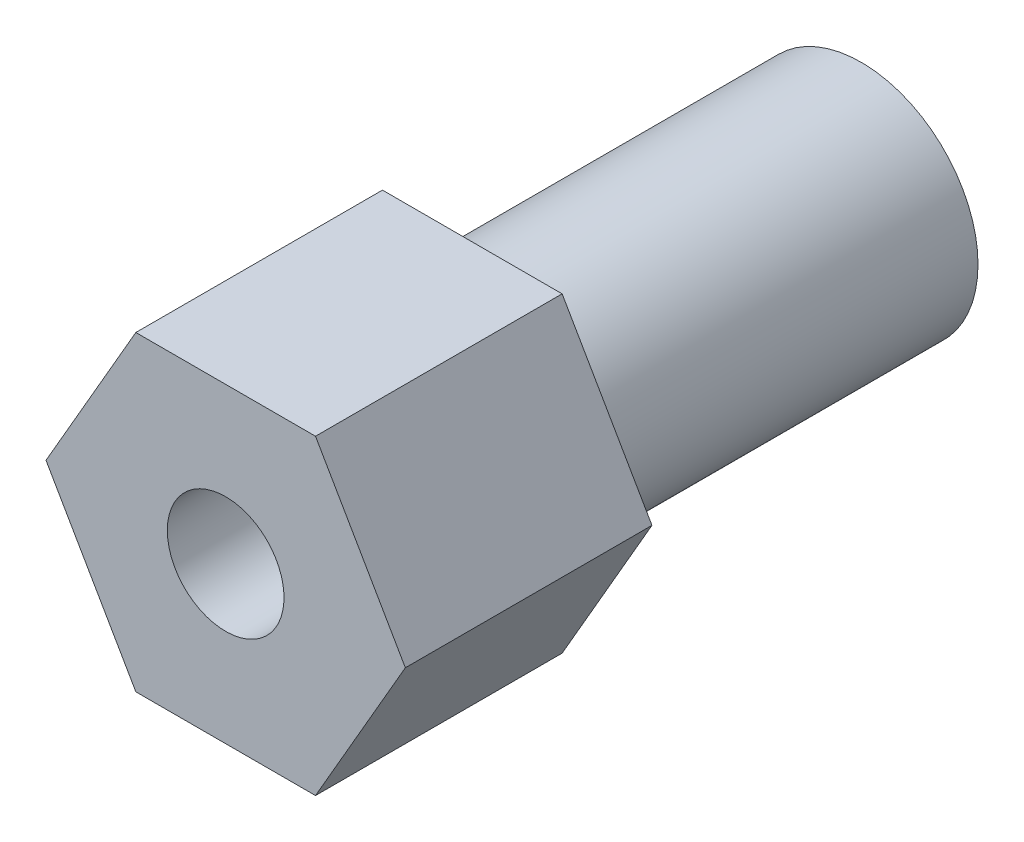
from build123d import *

# Parameters (mm, degrees)
EXTRUDE1_DEPTH     = 6.34
SKETCH2_R          = 3
EXTRUDE2_DEPTH     = 10
SKETCH3_R          = 1.5
CUT_EXTRUDE1_DEPTH = 18.445026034


with BuildPart() as part:
    # Sketch1 → Extrude1 (new body)
    with BuildSketch(Plane.XY):
        Polygon((2.309401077, -4), (4.618802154, 0), (2.309401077, 4), (-2.309401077, 4), (-4.618802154, 0), (-2.309401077, -4), align=None)
    extrude(amount=EXTRUDE1_DEPTH)

    # Sketch2 → Extrude2 (add)
    with BuildSketch(Plane(origin=(0, 0, 0), x_dir=(-1, 0, 0), z_dir=(0, 0, -1))):
        with Locations(Location((0, 0, 0), (0, 0, 180))):
            Circle(SKETCH2_R)
    extrude(amount=EXTRUDE2_DEPTH)

    # Sketch3 → Cut-Extrude1 (cut, through all)
    with BuildSketch(Plane(origin=(0, 0, -10), x_dir=(-1, 0, 0), z_dir=(0, 0, -1))):
        Circle(SKETCH3_R)
    extrude(amount=-CUT_EXTRUDE1_DEPTH, mode=Mode.SUBTRACT)


solid = part.part
